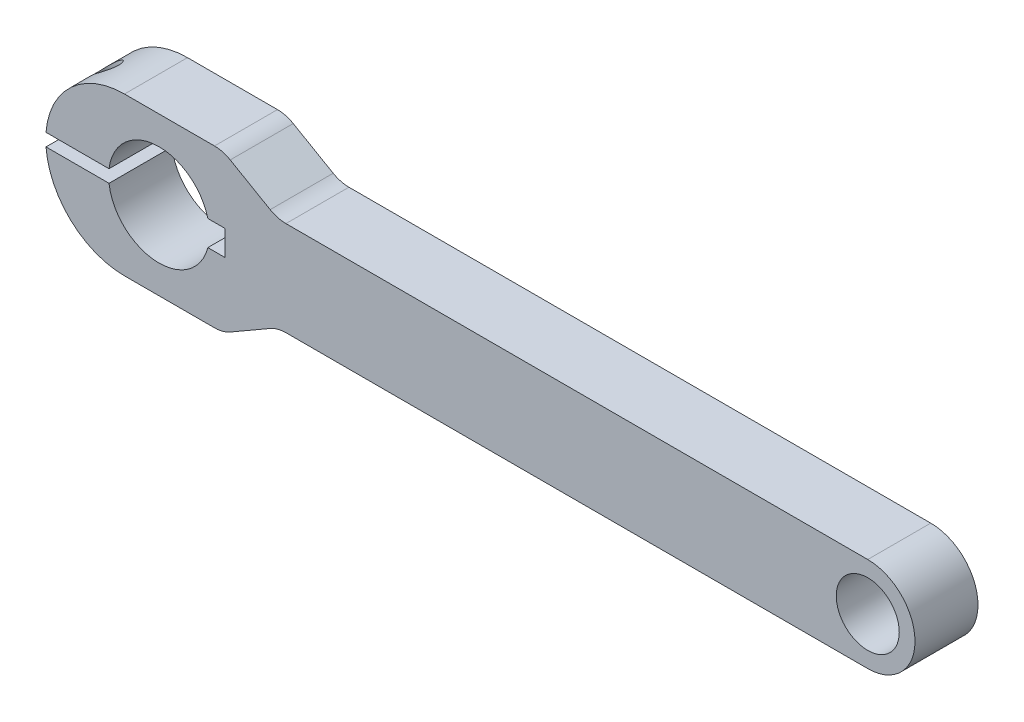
ISO-10303-21;
HEADER;
FILE_DESCRIPTION(('STEP AP214'),'2;1');
FILE_NAME('part.step','',(''),(''),'','','');
FILE_SCHEMA(('AUTOMOTIVE_DESIGN { 1 0 10303 214 1 1 1 1 }'));
ENDSEC;
DATA;
#1=APPLICATION_CONTEXT('core data for automotive mechanical design processes');
#2=APPLICATION_PROTOCOL_DEFINITION('international standard','automotive_design',2000,#1);
#3=PRODUCT_CONTEXT('',#1,'mechanical');
#4=PRODUCT('Part','Part','',(#3));
#5=PRODUCT_RELATED_PRODUCT_CATEGORY('part','',(#4));
#6=PRODUCT_DEFINITION_FORMATION('','',#4);
#7=PRODUCT_DEFINITION_CONTEXT('part definition',#1,'design');
#8=PRODUCT_DEFINITION('design','',#6,#7);
#9=PRODUCT_DEFINITION_SHAPE('','',#8);
#10=(LENGTH_UNIT() NAMED_UNIT(*) SI_UNIT(.MILLI.,.METRE.));
#11=(NAMED_UNIT(*) PLANE_ANGLE_UNIT() SI_UNIT($,.RADIAN.));
#12=(NAMED_UNIT(*) SI_UNIT($,.STERADIAN.) SOLID_ANGLE_UNIT());
#13=UNCERTAINTY_MEASURE_WITH_UNIT(LENGTH_MEASURE(1.E-05),#10,'distance_accuracy_value','');
#14=(GEOMETRIC_REPRESENTATION_CONTEXT(3) GLOBAL_UNCERTAINTY_ASSIGNED_CONTEXT((#13)) GLOBAL_UNIT_ASSIGNED_CONTEXT((#10,
#11,#12)) REPRESENTATION_CONTEXT('',''));
#15=CARTESIAN_POINT('',(0.,0.,0.));
#16=DIRECTION('',(0.,0.,1.));
#17=DIRECTION('',(1.,0.,0.));
#18=AXIS2_PLACEMENT_3D('',#15,#16,#17);
#19=CARTESIAN_POINT('',(-300.,177.493064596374,20.));
#20=DIRECTION('',(0.,0.,-1.));
#21=DIRECTION('',(-1.,0.,0.));
#22=AXIS2_PLACEMENT_3D('',#19,#20,#21);
#23=CYLINDRICAL_SURFACE('',#22,16.);
#24=DIRECTION('',(0.,0.,-1.));
#25=VECTOR('',#24,1.);
#26=CARTESIAN_POINT('',(-315.874507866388,179.493064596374,20.));
#27=LINE('',#26,#25);
#28=CARTESIAN_POINT('',(-315.874507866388,179.493064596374,0.));
#29=VERTEX_POINT('',#28);
#30=CARTESIAN_POINT('',(-315.874507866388,179.493064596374,20.));
#31=VERTEX_POINT('',#30);
#32=EDGE_CURVE('E182',#29,#31,#27,.F.);
#33=ORIENTED_EDGE('',*,*,#32,.F.);
#34=CARTESIAN_POINT('',(-300.,177.493064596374,0.));
#35=DIRECTION('',(0.,0.,1.));
#36=DIRECTION('',(1.,0.,0.));
#37=AXIS2_PLACEMENT_3D('',#34,#35,#36);
#38=CIRCLE('',#37,16.);
#39=CARTESIAN_POINT('',(-284.50806661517,181.493064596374,0.));
#40=VERTEX_POINT('',#39);
#41=EDGE_CURVE('E201',#40,#29,#38,.T.);
#42=ORIENTED_EDGE('',*,*,#41,.F.);
#43=DIRECTION('',(0.,0.,-1.));
#44=VECTOR('',#43,1.);
#45=CARTESIAN_POINT('',(-284.50806661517,181.493064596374,20.));
#46=LINE('',#45,#44);
#47=CARTESIAN_POINT('',(-284.50806661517,181.493064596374,20.));
#48=VERTEX_POINT('',#47);
#49=EDGE_CURVE('E292',#48,#40,#46,.T.);
#50=ORIENTED_EDGE('',*,*,#49,.F.);
#51=CARTESIAN_POINT('',(-300.,177.493064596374,20.));
#52=DIRECTION('',(0.,0.,1.));
#53=DIRECTION('',(1.,0.,0.));
#54=AXIS2_PLACEMENT_3D('',#51,#52,#53);
#55=CIRCLE('',#54,16.);
#56=EDGE_CURVE('E210',#48,#31,#55,.T.);
#57=ORIENTED_EDGE('',*,*,#56,.T.);
#58=EDGE_LOOP('',(#33,#42,#50,#57));
#59=FACE_BOUND('',#58,.T.);
#60=ADVANCED_FACE('F35',(#59),#23,.F.);
#61=CARTESIAN_POINT('',(-310.960972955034,177.493064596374,20.));
#62=DIRECTION('',(0.,0.,-1.));
#63=DIRECTION('',(-1.,0.,0.));
#64=AXIS2_PLACEMENT_3D('',#61,#62,#63);
#65=CYLINDRICAL_SURFACE('',#64,25.);
#66=CARTESIAN_POINT('',(-326.297546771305,197.236152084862,6.49999999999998));
#67=CARTESIAN_POINT('',(-326.531022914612,197.054774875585,6.50000406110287));
#68=CARTESIAN_POINT('',(-326.761650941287,196.868913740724,6.52337521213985));
#69=CARTESIAN_POINT('',(-327.098758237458,196.587401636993,6.59099591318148));
#70=CARTESIAN_POINT('',(-327.209900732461,196.49288990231,6.61906603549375));
#71=CARTESIAN_POINT('',(-327.428680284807,196.303578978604,6.68584927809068));
#72=CARTESIAN_POINT('',(-327.536318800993,196.208779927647,6.72455790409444));
#73=CARTESIAN_POINT('',(-327.757542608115,196.010606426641,6.81658997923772));
#74=CARTESIAN_POINT('',(-327.870729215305,195.907267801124,6.87094855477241));
#75=CARTESIAN_POINT('',(-328.091614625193,195.701959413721,6.99214461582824));
#76=CARTESIAN_POINT('',(-328.199311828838,195.599990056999,7.0589857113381));
#77=CARTESIAN_POINT('',(-328.408193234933,195.398803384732,7.20511385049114));
#78=CARTESIAN_POINT('',(-328.509389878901,195.299581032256,7.28437605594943));
#79=CARTESIAN_POINT('',(-328.70447241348,195.105196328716,7.45568333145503));
#80=CARTESIAN_POINT('',(-328.798362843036,195.010031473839,7.54772036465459));
#81=CARTESIAN_POINT('',(-328.99792728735,194.804710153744,7.76736027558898));
#82=CARTESIAN_POINT('',(-329.101483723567,194.696012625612,7.89830306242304));
#83=CARTESIAN_POINT('',(-329.292521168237,194.492293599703,8.18090270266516));
#84=CARTESIAN_POINT('',(-329.380028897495,194.397249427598,8.33252437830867));
#85=CARTESIAN_POINT('',(-329.517096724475,194.246519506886,8.62018204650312));
#86=CARTESIAN_POINT('',(-329.570766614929,194.186785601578,8.75211465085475));
#87=CARTESIAN_POINT('',(-329.662815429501,194.083601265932,9.02741904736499));
#88=CARTESIAN_POINT('',(-329.701206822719,194.040137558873,9.1707813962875));
#89=CARTESIAN_POINT('',(-329.74528959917,193.99003214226,9.39265005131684));
#90=CARTESIAN_POINT('',(-329.757764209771,193.975809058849,9.46818482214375));
#91=CARTESIAN_POINT('',(-329.777784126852,193.952950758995,9.62072392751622));
#92=CARTESIAN_POINT('',(-329.785332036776,193.944312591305,9.69772746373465));
#93=CARTESIAN_POINT('',(-329.795294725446,193.932905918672,9.85246631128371));
#94=CARTESIAN_POINT('',(-329.797711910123,193.930134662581,9.93020126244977));
#95=CARTESIAN_POINT('',(-329.797363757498,193.930533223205,10.0856179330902));
#96=CARTESIAN_POINT('',(-329.794599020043,193.933702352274,10.1632996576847));
#97=CARTESIAN_POINT('',(-329.780204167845,193.950183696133,10.3719956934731));
#98=CARTESIAN_POINT('',(-329.763724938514,193.969040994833,10.5023001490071));
#99=CARTESIAN_POINT('',(-329.717141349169,194.022049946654,10.7571178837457));
#100=CARTESIAN_POINT('',(-329.687029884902,194.056209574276,10.8816281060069));
#101=CARTESIAN_POINT('',(-329.603119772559,194.150660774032,11.1623663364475));
#102=CARTESIAN_POINT('',(-329.54479020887,194.215849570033,11.3155893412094));
#103=CARTESIAN_POINT('',(-329.411484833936,194.362815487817,11.6059462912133));
#104=CARTESIAN_POINT('',(-329.336474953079,194.44462653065,11.7430464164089));
#105=CARTESIAN_POINT('',(-329.139084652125,194.656538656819,12.0548725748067));
#106=CARTESIAN_POINT('',(-329.010008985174,194.792531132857,12.2213735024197));
#107=CARTESIAN_POINT('',(-328.801655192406,195.006492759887,12.4474417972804));
#108=CARTESIAN_POINT('',(-328.72964405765,195.079576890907,12.5189281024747));
#109=CARTESIAN_POINT('',(-328.581198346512,195.228302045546,12.6542442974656));
#110=CARTESIAN_POINT('',(-328.504764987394,195.303942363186,12.71807627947));
#111=CARTESIAN_POINT('',(-328.325006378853,195.479459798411,12.8558221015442));
#112=CARTESIAN_POINT('',(-328.220356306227,195.579952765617,12.9272210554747));
#113=CARTESIAN_POINT('',(-328.00527817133,195.782775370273,13.057691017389));
#114=CARTESIAN_POINT('',(-327.894848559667,195.885105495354,13.1167586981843));
#115=CARTESIAN_POINT('',(-327.668918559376,196.090587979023,13.2225612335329));
#116=CARTESIAN_POINT('',(-327.553417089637,196.193740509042,13.2692934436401));
#117=CARTESIAN_POINT('',(-327.317981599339,196.400015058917,13.3502560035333));
#118=CARTESIAN_POINT('',(-327.198045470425,196.503137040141,13.3844803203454));
#119=CARTESIAN_POINT('',(-326.953777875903,196.709095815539,13.4402242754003));
#120=CARTESIAN_POINT('',(-326.82942496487,196.811927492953,13.4616691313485));
#121=CARTESIAN_POINT('',(-326.577783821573,197.015908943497,13.491061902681));
#122=CARTESIAN_POINT('',(-326.450495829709,197.117058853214,13.4990109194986));
#123=CARTESIAN_POINT('',(-326.194021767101,197.316802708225,13.5008145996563));
#124=CARTESIAN_POINT('',(-326.064837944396,197.415399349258,13.4946847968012));
#125=CARTESIAN_POINT('',(-325.805617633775,197.609295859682,13.4677070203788));
#126=CARTESIAN_POINT('',(-325.675581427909,197.704596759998,13.4468636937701));
#127=CARTESIAN_POINT('',(-325.347918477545,197.93994329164,13.3747857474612));
#128=CARTESIAN_POINT('',(-325.150488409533,198.07734063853,13.3133605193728));
#129=CARTESIAN_POINT('',(-324.762832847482,198.339247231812,13.1525576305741));
#130=CARTESIAN_POINT('',(-324.572598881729,198.463771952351,13.0532262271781));
#131=CARTESIAN_POINT('',(-324.234373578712,198.679164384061,12.8333035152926));
#132=CARTESIAN_POINT('',(-324.084326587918,198.772278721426,12.7181377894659));
#133=CARTESIAN_POINT('',(-323.871743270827,198.901449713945,12.5248150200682));
#134=CARTESIAN_POINT('',(-323.802933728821,198.942773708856,12.4569080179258));
#135=CARTESIAN_POINT('',(-323.670234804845,199.021664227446,12.3144528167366));
#136=CARTESIAN_POINT('',(-323.606343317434,199.05923236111,12.2399074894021));
#137=CARTESIAN_POINT('',(-323.483855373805,199.13058940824,12.0839950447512));
#138=CARTESIAN_POINT('',(-323.425296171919,199.164352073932,12.0025866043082));
#139=CARTESIAN_POINT('',(-323.314759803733,199.2275533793,11.8338877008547));
#140=CARTESIAN_POINT('',(-323.262779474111,199.256994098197,11.7466000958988));
#141=CARTESIAN_POINT('',(-323.166131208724,199.311341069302,11.5667349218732));
#142=CARTESIAN_POINT('',(-323.1214622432,199.336247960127,11.4741581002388));
#143=CARTESIAN_POINT('',(-323.040120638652,199.381334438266,11.2844539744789));
#144=CARTESIAN_POINT('',(-323.003446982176,199.401514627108,11.18732725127));
#145=CARTESIAN_POINT('',(-322.942294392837,199.435011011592,11.000422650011));
#146=CARTESIAN_POINT('',(-322.916912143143,199.448841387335,10.9110312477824));
#147=CARTESIAN_POINT('',(-322.873251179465,199.472560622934,10.729982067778));
#148=CARTESIAN_POINT('',(-322.854974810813,199.482448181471,10.6383235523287));
#149=CARTESIAN_POINT('',(-322.825801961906,199.498202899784,10.4535663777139));
#150=CARTESIAN_POINT('',(-322.814899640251,199.504073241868,10.3604689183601));
#151=CARTESIAN_POINT('',(-322.800591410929,199.511772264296,10.1735245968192));
#152=CARTESIAN_POINT('',(-322.797188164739,199.513599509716,10.079677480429));
#153=CARTESIAN_POINT('',(-322.798298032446,199.513006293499,9.81073526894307));
#154=CARTESIAN_POINT('',(-322.812203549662,199.505545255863,9.63556978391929));
#155=CARTESIAN_POINT('',(-322.865754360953,199.476628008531,9.29054258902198));
#156=CARTESIAN_POINT('',(-322.905396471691,199.45517352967,9.12068022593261));
#157=CARTESIAN_POINT('',(-323.008404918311,199.398835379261,8.79117814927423));
#158=CARTESIAN_POINT('',(-323.071708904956,199.363986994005,8.63151284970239));
#159=CARTESIAN_POINT('',(-323.21927458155,199.281620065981,8.32575870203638));
#160=CARTESIAN_POINT('',(-323.303539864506,199.234099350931,8.17967218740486));
#161=CARTESIAN_POINT('',(-323.494630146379,199.124526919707,7.89658521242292));
#162=CARTESIAN_POINT('',(-323.602419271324,199.061834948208,7.76048602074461));
#163=CARTESIAN_POINT('',(-323.833276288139,198.924859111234,7.50869877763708));
#164=CARTESIAN_POINT('',(-323.956348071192,198.850572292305,7.39301594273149));
#165=CARTESIAN_POINT('',(-324.227276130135,198.683465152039,7.1719821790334));
#166=CARTESIAN_POINT('',(-324.376377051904,198.589515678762,7.06901739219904));
#167=CARTESIAN_POINT('',(-324.683286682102,198.391187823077,6.88939869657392));
#168=CARTESIAN_POINT('',(-324.84110317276,198.286800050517,6.8127687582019));
#169=CARTESIAN_POINT('',(-325.185730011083,198.052880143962,6.6753389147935));
#170=CARTESIAN_POINT('',(-325.373270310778,197.921948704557,6.61877872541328));
#171=CARTESIAN_POINT('',(-325.748873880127,197.651720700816,6.5379457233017));
#172=CARTESIAN_POINT('',(-325.936936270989,197.512434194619,6.5136348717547));
#173=CARTESIAN_POINT('',(-326.181523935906,197.325872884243,6.5014362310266));
#174=CARTESIAN_POINT('',(-326.239623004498,197.281150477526,6.4999989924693));
#175=CARTESIAN_POINT('',(-326.297546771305,197.236152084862,6.49999999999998));
#176=B_SPLINE_CURVE_WITH_KNOTS('',3,(#66,#67,#68,#69,#70,#71,#72,#73,#74,#75,#76,#77,#78,#79,
#80,#81,#82,#83,#84,#85,#86,#87,#88,#89,#90,#91,#92,#93,#94,#95,#96,#97,#98,#99,#100,#101,#102,
#103,#104,#105,#106,#107,#108,#109,#110,#111,#112,#113,#114,#115,#116,#117,#118,#119,#120,#121,
#122,#123,#124,#125,#126,#127,#128,#129,#130,#131,#132,#133,#134,#135,#136,#137,#138,#139,#140,
#141,#142,#143,#144,#145,#146,#147,#148,#149,#150,#151,#152,#153,#154,#155,#156,#157,#158,#159,
#160,#161,#162,#163,#164,#165,#166,#167,#168,#169,#170,#171,#172,#173,#174,#175),.UNSPECIFIED.,
.T.,.F.,(4,2,2,2,2,2,2,2,2,2,2,2,2,2,2,2,2,2,2,2,2,2,2,2,2,2,2,2,2,2,2,2,2,2,2,2,2,2,2,2,2,2,2,
2,2,2,2,2,2,2,2,2,2,2,4),(0.,0.886740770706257,1.33216892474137,1.77740919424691,
2.26470657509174,2.75214510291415,3.23862106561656,3.72479235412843,4.32060203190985,
4.91541050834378,5.37713186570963,5.83847562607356,6.07176637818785,6.3049337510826,
6.53799176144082,6.77102279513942,7.16708561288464,7.56335507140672,8.08970498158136,
8.61714000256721,9.36502952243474,9.73994949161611,10.1147667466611,10.5992538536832,
11.0838715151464,11.5685929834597,12.0535479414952,12.5413135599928,13.0290393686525,
13.5162273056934,14.0032614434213,14.744856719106,15.4855498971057,16.1151153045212,
16.4301966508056,16.7451423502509,17.0621422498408,17.3789891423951,17.6957913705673,
18.0125532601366,18.2940323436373,18.5756042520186,18.8569528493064,19.138401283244,
19.663269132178,20.1880720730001,20.7115017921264,21.2350212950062,21.7864861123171,
22.3380916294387,22.9480271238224,23.5585163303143,24.2627812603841,24.9662147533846,
25.1862088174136),.UNSPECIFIED.);
#177=CARTESIAN_POINT('',(-326.297546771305,197.236152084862,6.49999999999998));
#178=VERTEX_POINT('',#177);
#179=EDGE_CURVE('E195',#178,#178,#176,.T.);
#180=ORIENTED_EDGE('',*,*,#179,.F.);
#181=EDGE_LOOP('',(#180));
#182=FACE_BOUND('',#181,.T.);
#183=DIRECTION('',(0.,0.,-1.));
#184=VECTOR('',#183,1.);
#185=CARTESIAN_POINT('',(-335.880844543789,179.493064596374,20.));
#186=LINE('',#185,#184);
#187=CARTESIAN_POINT('',(-335.880844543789,179.493064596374,20.));
#188=VERTEX_POINT('',#187);
#189=CARTESIAN_POINT('',(-335.880844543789,179.493064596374,0.));
#190=VERTEX_POINT('',#189);
#191=EDGE_CURVE('E11',#188,#190,#186,.T.);
#192=ORIENTED_EDGE('',*,*,#191,.F.);
#193=CARTESIAN_POINT('',(-310.960972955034,177.493064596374,20.));
#194=DIRECTION('',(0.,0.,-1.));
#195=DIRECTION('',(-1.,0.,0.));
#196=AXIS2_PLACEMENT_3D('',#193,#194,#195);
#197=CIRCLE('',#196,25.);
#198=CARTESIAN_POINT('',(-310.960972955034,202.493064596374,20.));
#199=VERTEX_POINT('',#198);
#200=EDGE_CURVE('E426',#188,#199,#197,.T.);
#201=ORIENTED_EDGE('',*,*,#200,.T.);
#202=DIRECTION('',(0.,0.,-1.));
#203=VECTOR('',#202,1.);
#204=CARTESIAN_POINT('',(-310.960972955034,202.493064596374,20.));
#205=LINE('',#204,#203);
#206=CARTESIAN_POINT('',(-310.960972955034,202.493064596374,0.));
#207=VERTEX_POINT('',#206);
#208=EDGE_CURVE('E416',#199,#207,#205,.T.);
#209=ORIENTED_EDGE('',*,*,#208,.T.);
#210=CARTESIAN_POINT('',(-310.960972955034,177.493064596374,0.));
#211=DIRECTION('',(0.,0.,-1.));
#212=DIRECTION('',(-1.,0.,0.));
#213=AXIS2_PLACEMENT_3D('',#210,#211,#212);
#214=CIRCLE('',#213,25.);
#215=EDGE_CURVE('E528',#190,#207,#214,.T.);
#216=ORIENTED_EDGE('',*,*,#215,.F.);
#217=EDGE_LOOP('',(#192,#201,#209,#216));
#218=FACE_BOUND('',#217,.T.);
#219=ADVANCED_FACE('F339',(#182,#218),#65,.T.);
#220=CARTESIAN_POINT('',(-300.,177.493064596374,20.));
#221=DIRECTION('',(0.,0.,1.));
#222=DIRECTION('',(1.,0.,0.));
#223=AXIS2_PLACEMENT_3D('',#220,#221,#222);
#224=PLANE('',#223);
#225=DIRECTION('',(1.,0.,0.));
#226=VECTOR('',#225,1.);
#227=CARTESIAN_POINT('',(-314.095191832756,179.493064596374,20.));
#228=LINE('',#227,#226);
#229=EDGE_CURVE('E55',#188,#31,#228,.T.);
#230=ORIENTED_EDGE('',*,*,#229,.T.);
#231=ORIENTED_EDGE('',*,*,#56,.F.);
#232=DIRECTION('',(-1.,0.,0.));
#233=VECTOR('',#232,1.);
#234=CARTESIAN_POINT('',(-279.,181.493064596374,20.));
#235=LINE('',#234,#233);
#236=CARTESIAN_POINT('',(-279.,181.493064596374,20.));
#237=VERTEX_POINT('',#236);
#238=EDGE_CURVE('E442',#237,#48,#235,.T.);
#239=ORIENTED_EDGE('',*,*,#238,.F.);
#240=DIRECTION('',(0.,1.,0.));
#241=VECTOR('',#240,1.);
#242=CARTESIAN_POINT('',(-279.,181.493064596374,20.));
#243=LINE('',#242,#241);
#244=CARTESIAN_POINT('',(-279.,173.493064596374,20.));
#245=VERTEX_POINT('',#244);
#246=EDGE_CURVE('E423',#245,#237,#243,.T.);
#247=ORIENTED_EDGE('',*,*,#246,.F.);
#248=DIRECTION('',(1.,0.,0.));
#249=VECTOR('',#248,1.);
#250=CARTESIAN_POINT('',(-279.,173.493064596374,20.));
#251=LINE('',#250,#249);
#252=CARTESIAN_POINT('',(-284.50806661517,173.493064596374,20.));
#253=VERTEX_POINT('',#252);
#254=EDGE_CURVE('E434',#253,#245,#251,.T.);
#255=ORIENTED_EDGE('',*,*,#254,.F.);
#256=CARTESIAN_POINT('',(-315.874507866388,175.493064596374,20.));
#257=VERTEX_POINT('',#256);
#258=EDGE_CURVE('E204',#257,#253,#55,.T.);
#259=ORIENTED_EDGE('',*,*,#258,.F.);
#260=DIRECTION('',(-1.,0.,0.));
#261=VECTOR('',#260,1.);
#262=CARTESIAN_POINT('',(-314.095191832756,175.493064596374,20.));
#263=LINE('',#262,#261);
#264=CARTESIAN_POINT('',(-335.880844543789,175.493064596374,20.));
#265=VERTEX_POINT('',#264);
#266=EDGE_CURVE('E178',#257,#265,#263,.T.);
#267=ORIENTED_EDGE('',*,*,#266,.T.);
#268=CARTESIAN_POINT('',(-310.960972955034,152.493064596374,20.));
#269=VERTEX_POINT('',#268);
#270=EDGE_CURVE('E420',#269,#265,#197,.T.);
#271=ORIENTED_EDGE('',*,*,#270,.F.);
#272=DIRECTION('',(1.,0.,0.));
#273=VECTOR('',#272,1.);
#274=CARTESIAN_POINT('',(-300.,152.493064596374,20.));
#275=LINE('',#274,#273);
#276=CARTESIAN_POINT('',(-282.391265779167,152.493064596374,20.));
#277=VERTEX_POINT('',#276);
#278=EDGE_CURVE('E212',#269,#277,#275,.T.);
#279=ORIENTED_EDGE('',*,*,#278,.T.);
#280=CARTESIAN_POINT('',(-282.391265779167,162.493064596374,20.));
#281=DIRECTION('',(0.,0.,1.));
#282=DIRECTION('',(1.,0.,0.));
#283=AXIS2_PLACEMENT_3D('',#280,#281,#282);
#284=CIRCLE('',#283,10.);
#285=CARTESIAN_POINT('',(-277.391265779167,153.83281055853,20.));
#286=VERTEX_POINT('',#285);
#287=EDGE_CURVE('E272',#277,#286,#284,.T.);
#288=ORIENTED_EDGE('',*,*,#287,.T.);
#289=DIRECTION('',(0.866025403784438,0.500000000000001,0.));
#290=VECTOR('',#289,1.);
#291=CARTESIAN_POINT('',(-279.711773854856,152.493064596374,20.));
#292=LINE('',#291,#290);
#293=CARTESIAN_POINT('',(-264.711773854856,161.153318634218,20.));
#294=VERTEX_POINT('',#293);
#295=EDGE_CURVE('E214',#286,#294,#292,.T.);
#296=ORIENTED_EDGE('',*,*,#295,.T.);
#297=CARTESIAN_POINT('',(-259.711773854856,152.493064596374,20.));
#298=DIRECTION('',(0.,0.,1.));
#299=DIRECTION('',(1.,0.,0.));
#300=AXIS2_PLACEMENT_3D('',#297,#298,#299);
#301=CIRCLE('',#300,10.);
#302=CARTESIAN_POINT('',(-259.711773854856,162.493064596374,20.));
#303=VERTEX_POINT('',#302);
#304=EDGE_CURVE('E286',#294,#303,#301,.F.);
#305=ORIENTED_EDGE('',*,*,#304,.T.);
#306=DIRECTION('',(1.,0.,0.));
#307=VECTOR('',#306,1.);
#308=CARTESIAN_POINT('',(-262.391265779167,162.493064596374,20.));
#309=LINE('',#308,#307);
#310=CARTESIAN_POINT('',(-75.,162.493064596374,20.));
#311=VERTEX_POINT('',#310);
#312=EDGE_CURVE('E218',#303,#311,#309,.T.);
#313=ORIENTED_EDGE('',*,*,#312,.T.);
#314=CARTESIAN_POINT('',(-75.,177.493064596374,20.));
#315=DIRECTION('',(0.,0.,1.));
#316=DIRECTION('',(1.,0.,0.));
#317=AXIS2_PLACEMENT_3D('',#314,#315,#316);
#318=CIRCLE('',#317,15.);
#319=CARTESIAN_POINT('',(-75.,192.493064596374,20.));
#320=VERTEX_POINT('',#319);
#321=EDGE_CURVE('E220',#311,#320,#318,.T.);
#322=ORIENTED_EDGE('',*,*,#321,.T.);
#323=DIRECTION('',(-1.,0.,0.));
#324=VECTOR('',#323,1.);
#325=CARTESIAN_POINT('',(-262.391265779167,192.493064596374,20.));
#326=LINE('',#325,#324);
#327=CARTESIAN_POINT('',(-259.711773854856,192.493064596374,20.));
#328=VERTEX_POINT('',#327);
#329=EDGE_CURVE('E222',#320,#328,#326,.T.);
#330=ORIENTED_EDGE('',*,*,#329,.T.);
#331=CARTESIAN_POINT('',(-259.711773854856,202.493064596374,20.));
#332=DIRECTION('',(0.,0.,1.));
#333=DIRECTION('',(1.,0.,0.));
#334=AXIS2_PLACEMENT_3D('',#331,#332,#333);
#335=CIRCLE('',#334,10.);
#336=CARTESIAN_POINT('',(-264.711773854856,193.83281055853,20.));
#337=VERTEX_POINT('',#336);
#338=EDGE_CURVE('E290',#328,#337,#335,.F.);
#339=ORIENTED_EDGE('',*,*,#338,.T.);
#340=DIRECTION('',(-0.866025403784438,0.500000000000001,0.));
#341=VECTOR('',#340,1.);
#342=CARTESIAN_POINT('',(-279.711773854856,202.493064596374,20.));
#343=LINE('',#342,#341);
#344=CARTESIAN_POINT('',(-277.391265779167,201.153318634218,20.));
#345=VERTEX_POINT('',#344);
#346=EDGE_CURVE('E225',#337,#345,#343,.T.);
#347=ORIENTED_EDGE('',*,*,#346,.T.);
#348=CARTESIAN_POINT('',(-282.391265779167,192.493064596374,20.));
#349=DIRECTION('',(0.,0.,1.));
#350=DIRECTION('',(1.,0.,0.));
#351=AXIS2_PLACEMENT_3D('',#348,#349,#350);
#352=CIRCLE('',#351,10.);
#353=CARTESIAN_POINT('',(-282.391265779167,202.493064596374,20.));
#354=VERTEX_POINT('',#353);
#355=EDGE_CURVE('E270',#345,#354,#352,.T.);
#356=ORIENTED_EDGE('',*,*,#355,.T.);
#357=DIRECTION('',(-1.,0.,0.));
#358=VECTOR('',#357,1.);
#359=CARTESIAN_POINT('',(-300.,202.493064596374,20.));
#360=LINE('',#359,#358);
#361=EDGE_CURVE('E228',#354,#199,#360,.T.);
#362=ORIENTED_EDGE('',*,*,#361,.T.);
#363=ORIENTED_EDGE('',*,*,#200,.F.);
#364=EDGE_LOOP('',(#230,#231,#239,#247,#255,#259,#267,#271,#279,#288,#296,#305,#313,#322,#330,
#339,#347,#356,#362,#363));
#365=FACE_BOUND('',#364,.T.);
#366=CARTESIAN_POINT('',(-75.,177.493064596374,20.));
#367=DIRECTION('',(0.,0.,1.));
#368=DIRECTION('',(1.,0.,0.));
#369=AXIS2_PLACEMENT_3D('',#366,#367,#368);
#370=CIRCLE('',#369,10.);
#371=CARTESIAN_POINT('',(-65.,177.493064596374,20.));
#372=VERTEX_POINT('',#371);
#373=EDGE_CURVE('E202',#372,#372,#370,.T.);
#374=ORIENTED_EDGE('',*,*,#373,.F.);
#375=EDGE_LOOP('',(#374));
#376=FACE_BOUND('',#375,.T.);
#377=ADVANCED_FACE('F347',(#365,#376),#224,.T.);
#378=CARTESIAN_POINT('',(-300.,177.493064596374,0.));
#379=DIRECTION('',(0.,0.,1.));
#380=DIRECTION('',(1.,0.,0.));
#381=AXIS2_PLACEMENT_3D('',#378,#379,#380);
#382=PLANE('',#381);
#383=ORIENTED_EDGE('',*,*,#41,.T.);
#384=DIRECTION('',(1.,0.,0.));
#385=VECTOR('',#384,1.);
#386=CARTESIAN_POINT('',(-314.095191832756,179.493064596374,0.));
#387=LINE('',#386,#385);
#388=EDGE_CURVE('E194',#190,#29,#387,.T.);
#389=ORIENTED_EDGE('',*,*,#388,.F.);
#390=ORIENTED_EDGE('',*,*,#215,.T.);
#391=DIRECTION('',(-1.,0.,0.));
#392=VECTOR('',#391,1.);
#393=CARTESIAN_POINT('',(-300.,202.493064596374,0.));
#394=LINE('',#393,#392);
#395=CARTESIAN_POINT('',(-282.391265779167,202.493064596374,0.));
#396=VERTEX_POINT('',#395);
#397=EDGE_CURVE('E215',#396,#207,#394,.T.);
#398=ORIENTED_EDGE('',*,*,#397,.F.);
#399=CARTESIAN_POINT('',(-282.391265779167,192.493064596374,0.));
#400=DIRECTION('',(0.,0.,1.));
#401=DIRECTION('',(1.,0.,0.));
#402=AXIS2_PLACEMENT_3D('',#399,#400,#401);
#403=CIRCLE('',#402,10.);
#404=CARTESIAN_POINT('',(-277.391265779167,201.153318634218,0.));
#405=VERTEX_POINT('',#404);
#406=EDGE_CURVE('E262',#396,#405,#403,.F.);
#407=ORIENTED_EDGE('',*,*,#406,.T.);
#408=DIRECTION('',(-0.866025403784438,0.500000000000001,0.));
#409=VECTOR('',#408,1.);
#410=CARTESIAN_POINT('',(-279.711773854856,202.493064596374,0.));
#411=LINE('',#410,#409);
#412=CARTESIAN_POINT('',(-264.711773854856,193.83281055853,0.));
#413=VERTEX_POINT('',#412);
#414=EDGE_CURVE('E244',#413,#405,#411,.T.);
#415=ORIENTED_EDGE('',*,*,#414,.F.);
#416=CARTESIAN_POINT('',(-259.711773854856,202.493064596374,0.));
#417=DIRECTION('',(0.,0.,1.));
#418=DIRECTION('',(1.,0.,0.));
#419=AXIS2_PLACEMENT_3D('',#416,#417,#418);
#420=CIRCLE('',#419,10.);
#421=CARTESIAN_POINT('',(-259.711773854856,192.493064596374,0.));
#422=VERTEX_POINT('',#421);
#423=EDGE_CURVE('E288',#413,#422,#420,.T.);
#424=ORIENTED_EDGE('',*,*,#423,.T.);
#425=DIRECTION('',(-1.,0.,0.));
#426=VECTOR('',#425,1.);
#427=CARTESIAN_POINT('',(-262.391265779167,192.493064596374,0.));
#428=LINE('',#427,#426);
#429=CARTESIAN_POINT('',(-75.,192.493064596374,0.));
#430=VERTEX_POINT('',#429);
#431=EDGE_CURVE('E241',#430,#422,#428,.T.);
#432=ORIENTED_EDGE('',*,*,#431,.F.);
#433=CARTESIAN_POINT('',(-75.,177.493064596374,0.));
#434=DIRECTION('',(0.,0.,1.));
#435=DIRECTION('',(1.,0.,0.));
#436=AXIS2_PLACEMENT_3D('',#433,#434,#435);
#437=CIRCLE('',#436,15.);
#438=CARTESIAN_POINT('',(-75.,162.493064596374,0.));
#439=VERTEX_POINT('',#438);
#440=EDGE_CURVE('E239',#439,#430,#437,.T.);
#441=ORIENTED_EDGE('',*,*,#440,.F.);
#442=DIRECTION('',(1.,0.,0.));
#443=VECTOR('',#442,1.);
#444=CARTESIAN_POINT('',(-262.391265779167,162.493064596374,0.));
#445=LINE('',#444,#443);
#446=CARTESIAN_POINT('',(-259.711773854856,162.493064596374,0.));
#447=VERTEX_POINT('',#446);
#448=EDGE_CURVE('E237',#447,#439,#445,.T.);
#449=ORIENTED_EDGE('',*,*,#448,.F.);
#450=CARTESIAN_POINT('',(-259.711773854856,152.493064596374,0.));
#451=DIRECTION('',(0.,0.,1.));
#452=DIRECTION('',(1.,0.,0.));
#453=AXIS2_PLACEMENT_3D('',#450,#451,#452);
#454=CIRCLE('',#453,10.);
#455=CARTESIAN_POINT('',(-264.711773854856,161.153318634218,0.));
#456=VERTEX_POINT('',#455);
#457=EDGE_CURVE('E284',#447,#456,#454,.T.);
#458=ORIENTED_EDGE('',*,*,#457,.T.);
#459=DIRECTION('',(0.866025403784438,0.500000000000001,0.));
#460=VECTOR('',#459,1.);
#461=CARTESIAN_POINT('',(-279.711773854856,152.493064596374,0.));
#462=LINE('',#461,#460);
#463=CARTESIAN_POINT('',(-277.391265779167,153.83281055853,0.));
#464=VERTEX_POINT('',#463);
#465=EDGE_CURVE('E234',#464,#456,#462,.T.);
#466=ORIENTED_EDGE('',*,*,#465,.F.);
#467=CARTESIAN_POINT('',(-282.391265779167,162.493064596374,0.));
#468=DIRECTION('',(0.,0.,1.));
#469=DIRECTION('',(1.,0.,0.));
#470=AXIS2_PLACEMENT_3D('',#467,#468,#469);
#471=CIRCLE('',#470,10.);
#472=CARTESIAN_POINT('',(-282.391265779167,152.493064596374,0.));
#473=VERTEX_POINT('',#472);
#474=EDGE_CURVE('E264',#464,#473,#471,.F.);
#475=ORIENTED_EDGE('',*,*,#474,.T.);
#476=DIRECTION('',(1.,0.,0.));
#477=VECTOR('',#476,1.);
#478=CARTESIAN_POINT('',(-300.,152.493064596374,0.));
#479=LINE('',#478,#477);
#480=CARTESIAN_POINT('',(-310.960972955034,152.493064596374,0.));
#481=VERTEX_POINT('',#480);
#482=EDGE_CURVE('E232',#481,#473,#479,.T.);
#483=ORIENTED_EDGE('',*,*,#482,.F.);
#484=CARTESIAN_POINT('',(-335.880844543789,175.493064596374,0.));
#485=VERTEX_POINT('',#484);
#486=EDGE_CURVE('E193',#481,#485,#214,.T.);
#487=ORIENTED_EDGE('',*,*,#486,.T.);
#488=DIRECTION('',(-1.,0.,0.));
#489=VECTOR('',#488,1.);
#490=CARTESIAN_POINT('',(-314.095191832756,175.493064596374,0.));
#491=LINE('',#490,#489);
#492=CARTESIAN_POINT('',(-315.874507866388,175.493064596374,0.));
#493=VERTEX_POINT('',#492);
#494=EDGE_CURVE('E63',#493,#485,#491,.T.);
#495=ORIENTED_EDGE('',*,*,#494,.F.);
#496=CARTESIAN_POINT('',(-284.50806661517,173.493064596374,0.));
#497=VERTEX_POINT('',#496);
#498=EDGE_CURVE('E190',#493,#497,#38,.T.);
#499=ORIENTED_EDGE('',*,*,#498,.T.);
#500=DIRECTION('',(1.,0.,0.));
#501=VECTOR('',#500,1.);
#502=CARTESIAN_POINT('',(-279.,173.493064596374,0.));
#503=LINE('',#502,#501);
#504=CARTESIAN_POINT('',(-279.,173.493064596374,0.));
#505=VERTEX_POINT('',#504);
#506=EDGE_CURVE('E437',#497,#505,#503,.T.);
#507=ORIENTED_EDGE('',*,*,#506,.T.);
#508=DIRECTION('',(0.,1.,0.));
#509=VECTOR('',#508,1.);
#510=CARTESIAN_POINT('',(-279.,181.493064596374,0.));
#511=LINE('',#510,#509);
#512=CARTESIAN_POINT('',(-279.,181.493064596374,0.));
#513=VERTEX_POINT('',#512);
#514=EDGE_CURVE('E430',#505,#513,#511,.T.);
#515=ORIENTED_EDGE('',*,*,#514,.T.);
#516=DIRECTION('',(-1.,0.,0.));
#517=VECTOR('',#516,1.);
#518=CARTESIAN_POINT('',(-279.,181.493064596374,0.));
#519=LINE('',#518,#517);
#520=EDGE_CURVE('E433',#513,#40,#519,.T.);
#521=ORIENTED_EDGE('',*,*,#520,.T.);
#522=EDGE_LOOP('',(#383,#389,#390,#398,#407,#415,#424,#432,#441,#449,#458,#466,#475,#483,#487,
#495,#499,#507,#515,#521));
#523=FACE_BOUND('',#522,.T.);
#524=CARTESIAN_POINT('',(-75.,177.493064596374,0.));
#525=DIRECTION('',(0.,0.,1.));
#526=DIRECTION('',(1.,0.,0.));
#527=AXIS2_PLACEMENT_3D('',#524,#525,#526);
#528=CIRCLE('',#527,10.);
#529=CARTESIAN_POINT('',(-65.,177.493064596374,0.));
#530=VERTEX_POINT('',#529);
#531=EDGE_CURVE('E206',#530,#530,#528,.T.);
#532=ORIENTED_EDGE('',*,*,#531,.T.);
#533=EDGE_LOOP('',(#532));
#534=FACE_BOUND('',#533,.T.);
#535=ADVANCED_FACE('F187',(#523,#534),#382,.F.);
#536=CARTESIAN_POINT('',(-300.,152.493064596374,20.));
#537=DIRECTION('',(0.,1.,0.));
#538=DIRECTION('',(-1.,0.,0.));
#539=AXIS2_PLACEMENT_3D('',#536,#537,#538);
#540=PLANE('',#539);
#541=DIRECTION('',(0.,0.,-1.));
#542=VECTOR('',#541,1.);
#543=CARTESIAN_POINT('',(-282.391265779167,152.493064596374,20.));
#544=LINE('',#543,#542);
#545=EDGE_CURVE('E267',#473,#277,#544,.F.);
#546=ORIENTED_EDGE('',*,*,#545,.T.);
#547=ORIENTED_EDGE('',*,*,#278,.F.);
#548=DIRECTION('',(0.,0.,-1.));
#549=VECTOR('',#548,1.);
#550=CARTESIAN_POINT('',(-310.960972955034,152.493064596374,20.));
#551=LINE('',#550,#549);
#552=EDGE_CURVE('E419',#269,#481,#551,.T.);
#553=ORIENTED_EDGE('',*,*,#552,.T.);
#554=ORIENTED_EDGE('',*,*,#482,.T.);
#555=EDGE_LOOP('',(#546,#547,#553,#554));
#556=FACE_BOUND('',#555,.T.);
#557=ADVANCED_FACE('F386',(#556),#540,.F.);
#558=CARTESIAN_POINT('',(-279.711773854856,152.493064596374,20.));
#559=DIRECTION('',(-0.500000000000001,0.866025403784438,0.));
#560=DIRECTION('',(-0.866025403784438,-0.500000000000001,0.));
#561=AXIS2_PLACEMENT_3D('',#558,#559,#560);
#562=PLANE('',#561);
#563=ORIENTED_EDGE('',*,*,#465,.T.);
#564=DIRECTION('',(0.,0.,-1.));
#565=VECTOR('',#564,1.);
#566=CARTESIAN_POINT('',(-264.711773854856,161.153318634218,20.));
#567=LINE('',#566,#565);
#568=EDGE_CURVE('E260',#456,#294,#567,.F.);
#569=ORIENTED_EDGE('',*,*,#568,.T.);
#570=ORIENTED_EDGE('',*,*,#295,.F.);
#571=DIRECTION('',(0.,0.,-1.));
#572=VECTOR('',#571,1.);
#573=CARTESIAN_POINT('',(-277.391265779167,153.83281055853,20.));
#574=LINE('',#573,#572);
#575=EDGE_CURVE('E257',#286,#464,#574,.T.);
#576=ORIENTED_EDGE('',*,*,#575,.T.);
#577=EDGE_LOOP('',(#563,#569,#570,#576));
#578=FACE_BOUND('',#577,.T.);
#579=ADVANCED_FACE('F382',(#578),#562,.F.);
#580=CARTESIAN_POINT('',(-262.391265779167,162.493064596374,20.));
#581=DIRECTION('',(0.,1.,0.));
#582=DIRECTION('',(0.,0.,1.));
#583=AXIS2_PLACEMENT_3D('',#580,#581,#582);
#584=PLANE('',#583);
#585=ORIENTED_EDGE('',*,*,#312,.F.);
#586=DIRECTION('',(0.,0.,-1.));
#587=VECTOR('',#586,1.);
#588=CARTESIAN_POINT('',(-259.711773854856,162.493064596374,0.));
#589=LINE('',#588,#587);
#590=EDGE_CURVE('E254',#303,#447,#589,.T.);
#591=ORIENTED_EDGE('',*,*,#590,.T.);
#592=ORIENTED_EDGE('',*,*,#448,.T.);
#593=DIRECTION('',(0.,0.,-1.));
#594=VECTOR('',#593,1.);
#595=CARTESIAN_POINT('',(-75.,162.493064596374,20.));
#596=LINE('',#595,#594);
#597=EDGE_CURVE('E251',#311,#439,#596,.T.);
#598=ORIENTED_EDGE('',*,*,#597,.F.);
#599=EDGE_LOOP('',(#585,#591,#592,#598));
#600=FACE_BOUND('',#599,.T.);
#601=ADVANCED_FACE('F378',(#600),#584,.F.);
#602=CARTESIAN_POINT('',(-75.,177.493064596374,20.));
#603=DIRECTION('',(0.,0.,-1.));
#604=DIRECTION('',(-1.,0.,0.));
#605=AXIS2_PLACEMENT_3D('',#602,#603,#604);
#606=CYLINDRICAL_SURFACE('',#605,15.);
#607=ORIENTED_EDGE('',*,*,#440,.T.);
#608=DIRECTION('',(0.,0.,-1.));
#609=VECTOR('',#608,1.);
#610=CARTESIAN_POINT('',(-75.,192.493064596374,20.));
#611=LINE('',#610,#609);
#612=EDGE_CURVE('E231',#320,#430,#611,.T.);
#613=ORIENTED_EDGE('',*,*,#612,.F.);
#614=ORIENTED_EDGE('',*,*,#321,.F.);
#615=ORIENTED_EDGE('',*,*,#597,.T.);
#616=EDGE_LOOP('',(#607,#613,#614,#615));
#617=FACE_BOUND('',#616,.T.);
#618=ADVANCED_FACE('F374',(#617),#606,.T.);
#619=CARTESIAN_POINT('',(-262.391265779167,192.493064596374,20.));
#620=DIRECTION('',(0.,-1.,0.));
#621=DIRECTION('',(0.,0.,-1.));
#622=AXIS2_PLACEMENT_3D('',#619,#620,#621);
#623=PLANE('',#622);
#624=ORIENTED_EDGE('',*,*,#431,.T.);
#625=DIRECTION('',(0.,0.,-1.));
#626=VECTOR('',#625,1.);
#627=CARTESIAN_POINT('',(-259.711773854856,192.493064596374,20.));
#628=LINE('',#627,#626);
#629=EDGE_CURVE('E282',#422,#328,#628,.F.);
#630=ORIENTED_EDGE('',*,*,#629,.T.);
#631=ORIENTED_EDGE('',*,*,#329,.F.);
#632=ORIENTED_EDGE('',*,*,#612,.T.);
#633=EDGE_LOOP('',(#624,#630,#631,#632));
#634=FACE_BOUND('',#633,.T.);
#635=ADVANCED_FACE('F367',(#634),#623,.F.);
#636=CARTESIAN_POINT('',(-279.711773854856,202.493064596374,20.));
#637=DIRECTION('',(-0.500000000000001,-0.866025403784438,0.));
#638=DIRECTION('',(0.866025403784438,-0.500000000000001,0.));
#639=AXIS2_PLACEMENT_3D('',#636,#637,#638);
#640=PLANE('',#639);
#641=ORIENTED_EDGE('',*,*,#414,.T.);
#642=DIRECTION('',(0.,0.,-1.));
#643=VECTOR('',#642,1.);
#644=CARTESIAN_POINT('',(-277.391265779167,201.153318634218,20.));
#645=LINE('',#644,#643);
#646=EDGE_CURVE('E280',#405,#345,#645,.F.);
#647=ORIENTED_EDGE('',*,*,#646,.T.);
#648=ORIENTED_EDGE('',*,*,#346,.F.);
#649=DIRECTION('',(0.,0.,-1.));
#650=VECTOR('',#649,1.);
#651=CARTESIAN_POINT('',(-264.711773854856,193.83281055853,0.));
#652=LINE('',#651,#650);
#653=EDGE_CURVE('E277',#337,#413,#652,.T.);
#654=ORIENTED_EDGE('',*,*,#653,.T.);
#655=EDGE_LOOP('',(#641,#647,#648,#654));
#656=FACE_BOUND('',#655,.T.);
#657=ADVANCED_FACE('F361',(#656),#640,.F.);
#658=CARTESIAN_POINT('',(-300.,202.493064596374,20.));
#659=DIRECTION('',(0.,-1.,0.));
#660=DIRECTION('',(0.,0.,-1.));
#661=AXIS2_PLACEMENT_3D('',#658,#659,#660);
#662=PLANE('',#661);
#663=ORIENTED_EDGE('',*,*,#397,.T.);
#664=ORIENTED_EDGE('',*,*,#208,.F.);
#665=ORIENTED_EDGE('',*,*,#361,.F.);
#666=DIRECTION('',(0.,0.,-1.));
#667=VECTOR('',#666,1.);
#668=CARTESIAN_POINT('',(-282.391265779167,202.493064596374,20.));
#669=LINE('',#668,#667);
#670=EDGE_CURVE('E274',#354,#396,#669,.T.);
#671=ORIENTED_EDGE('',*,*,#670,.T.);
#672=EDGE_LOOP('',(#663,#664,#665,#671));
#673=FACE_BOUND('',#672,.T.);
#674=ADVANCED_FACE('F354',(#673),#662,.F.);
#675=DIRECTION('',(0.,0.,-1.));
#676=VECTOR('',#675,1.);
#677=CARTESIAN_POINT('',(-315.874507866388,175.493064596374,20.));
#678=LINE('',#677,#676);
#679=EDGE_CURVE('E175',#257,#493,#678,.T.);
#680=ORIENTED_EDGE('',*,*,#679,.F.);
#681=ORIENTED_EDGE('',*,*,#258,.T.);
#682=DIRECTION('',(0.,0.,-1.));
#683=VECTOR('',#682,1.);
#684=CARTESIAN_POINT('',(-284.50806661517,173.493064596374,20.));
#685=LINE('',#684,#683);
#686=EDGE_CURVE('E200',#497,#253,#685,.F.);
#687=ORIENTED_EDGE('',*,*,#686,.F.);
#688=ORIENTED_EDGE('',*,*,#498,.F.);
#689=EDGE_LOOP('',(#680,#681,#687,#688));
#690=FACE_BOUND('',#689,.T.);
#691=ADVANCED_FACE('F198',(#690),#23,.F.);
#692=CARTESIAN_POINT('',(-75.,177.493064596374,20.));
#693=DIRECTION('',(0.,0.,-1.));
#694=DIRECTION('',(-1.,0.,0.));
#695=AXIS2_PLACEMENT_3D('',#692,#693,#694);
#696=CYLINDRICAL_SURFACE('',#695,10.);
#697=ORIENTED_EDGE('',*,*,#373,.T.);
#698=EDGE_LOOP('',(#697));
#699=FACE_BOUND('',#698,.T.);
#700=ORIENTED_EDGE('',*,*,#531,.F.);
#701=EDGE_LOOP('',(#700));
#702=FACE_BOUND('',#701,.T.);
#703=ADVANCED_FACE('F353',(#699,#702),#696,.F.);
#704=CARTESIAN_POINT('',(-259.711773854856,152.493064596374,20.));
#705=DIRECTION('',(0.,0.,1.));
#706=DIRECTION('',(1.,0.,0.));
#707=AXIS2_PLACEMENT_3D('',#704,#705,#706);
#708=CYLINDRICAL_SURFACE('',#707,10.);
#709=ORIENTED_EDGE('',*,*,#304,.F.);
#710=ORIENTED_EDGE('',*,*,#568,.F.);
#711=ORIENTED_EDGE('',*,*,#457,.F.);
#712=ORIENTED_EDGE('',*,*,#590,.F.);
#713=EDGE_LOOP('',(#709,#710,#711,#712));
#714=FACE_BOUND('',#713,.T.);
#715=ADVANCED_FACE('F359',(#714),#708,.F.);
#716=CARTESIAN_POINT('',(-282.391265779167,162.493064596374,20.));
#717=DIRECTION('',(0.,0.,-1.));
#718=DIRECTION('',(-1.,0.,0.));
#719=AXIS2_PLACEMENT_3D('',#716,#717,#718);
#720=CYLINDRICAL_SURFACE('',#719,10.);
#721=ORIENTED_EDGE('',*,*,#287,.F.);
#722=ORIENTED_EDGE('',*,*,#545,.F.);
#723=ORIENTED_EDGE('',*,*,#474,.F.);
#724=ORIENTED_EDGE('',*,*,#575,.F.);
#725=EDGE_LOOP('',(#721,#722,#723,#724));
#726=FACE_BOUND('',#725,.T.);
#727=ADVANCED_FACE('F393',(#726),#720,.T.);
#728=CARTESIAN_POINT('',(-282.391265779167,192.493064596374,20.));
#729=DIRECTION('',(0.,0.,-1.));
#730=DIRECTION('',(-1.,0.,0.));
#731=AXIS2_PLACEMENT_3D('',#728,#729,#730);
#732=CYLINDRICAL_SURFACE('',#731,10.);
#733=ORIENTED_EDGE('',*,*,#355,.F.);
#734=ORIENTED_EDGE('',*,*,#646,.F.);
#735=ORIENTED_EDGE('',*,*,#406,.F.);
#736=ORIENTED_EDGE('',*,*,#670,.F.);
#737=EDGE_LOOP('',(#733,#734,#735,#736));
#738=FACE_BOUND('',#737,.T.);
#739=ADVANCED_FACE('F396',(#738),#732,.T.);
#740=CARTESIAN_POINT('',(-259.711773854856,202.493064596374,20.));
#741=DIRECTION('',(0.,0.,1.));
#742=DIRECTION('',(1.,0.,0.));
#743=AXIS2_PLACEMENT_3D('',#740,#741,#742);
#744=CYLINDRICAL_SURFACE('',#743,10.);
#745=ORIENTED_EDGE('',*,*,#338,.F.);
#746=ORIENTED_EDGE('',*,*,#629,.F.);
#747=ORIENTED_EDGE('',*,*,#423,.F.);
#748=ORIENTED_EDGE('',*,*,#653,.F.);
#749=EDGE_LOOP('',(#745,#746,#747,#748));
#750=FACE_BOUND('',#749,.T.);
#751=ADVANCED_FACE('F37',(#750),#744,.F.);
#752=CARTESIAN_POINT('',(-279.,181.493064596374,0.));
#753=DIRECTION('',(1.,0.,0.));
#754=DIRECTION('',(0.,0.,-1.));
#755=AXIS2_PLACEMENT_3D('',#752,#753,#754);
#756=PLANE('',#755);
#757=ORIENTED_EDGE('',*,*,#246,.T.);
#758=DIRECTION('',(0.,0.,1.));
#759=VECTOR('',#758,1.);
#760=CARTESIAN_POINT('',(-279.,181.493064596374,0.));
#761=LINE('',#760,#759);
#762=EDGE_CURVE('E439',#513,#237,#761,.T.);
#763=ORIENTED_EDGE('',*,*,#762,.F.);
#764=ORIENTED_EDGE('',*,*,#514,.F.);
#765=DIRECTION('',(0.,0.,1.));
#766=VECTOR('',#765,1.);
#767=CARTESIAN_POINT('',(-279.,173.493064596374,0.));
#768=LINE('',#767,#766);
#769=EDGE_CURVE('E445',#505,#245,#768,.T.);
#770=ORIENTED_EDGE('',*,*,#769,.T.);
#771=EDGE_LOOP('',(#757,#763,#764,#770));
#772=FACE_BOUND('',#771,.T.);
#773=ADVANCED_FACE('F403',(#772),#756,.F.);
#774=CARTESIAN_POINT('',(-279.,173.493064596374,0.));
#775=DIRECTION('',(0.,-1.,0.));
#776=DIRECTION('',(0.,0.,-1.));
#777=AXIS2_PLACEMENT_3D('',#774,#775,#776);
#778=PLANE('',#777);
#779=ORIENTED_EDGE('',*,*,#686,.T.);
#780=ORIENTED_EDGE('',*,*,#254,.T.);
#781=ORIENTED_EDGE('',*,*,#769,.F.);
#782=ORIENTED_EDGE('',*,*,#506,.F.);
#783=EDGE_LOOP('',(#779,#780,#781,#782));
#784=FACE_BOUND('',#783,.T.);
#785=ADVANCED_FACE('F535',(#784),#778,.F.);
#786=CARTESIAN_POINT('',(-279.,181.493064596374,0.));
#787=DIRECTION('',(0.,1.,0.));
#788=DIRECTION('',(0.,0.,1.));
#789=AXIS2_PLACEMENT_3D('',#786,#787,#788);
#790=PLANE('',#789);
#791=ORIENTED_EDGE('',*,*,#49,.T.);
#792=ORIENTED_EDGE('',*,*,#520,.F.);
#793=ORIENTED_EDGE('',*,*,#762,.T.);
#794=ORIENTED_EDGE('',*,*,#238,.T.);
#795=EDGE_LOOP('',(#791,#792,#793,#794));
#796=FACE_BOUND('',#795,.T.);
#797=ADVANCED_FACE('F337',(#796),#790,.F.);
#798=CARTESIAN_POINT('',(-326.297546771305,157.749977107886,17.));
#799=CARTESIAN_POINT('',(-326.531327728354,157.931582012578,16.9999997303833));
#800=CARTESIAN_POINT('',(-326.761907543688,158.117369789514,16.9882889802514));
#801=CARTESIAN_POINT('',(-327.215165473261,158.495997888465,16.9433344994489));
#802=CARTESIAN_POINT('',(-327.4378388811,158.688842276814,16.910078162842));
#803=CARTESIAN_POINT('',(-327.874693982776,159.080775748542,16.8236585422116));
#804=CARTESIAN_POINT('',(-328.088851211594,159.279880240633,16.7704419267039));
#805=CARTESIAN_POINT('',(-328.507247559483,159.682602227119,16.6456661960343));
#806=CARTESIAN_POINT('',(-328.711487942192,159.886219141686,16.5741094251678));
#807=CARTESIAN_POINT('',(-329.128054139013,160.31590529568,16.406497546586));
#808=CARTESIAN_POINT('',(-329.339371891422,160.542304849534,16.3087854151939));
#809=CARTESIAN_POINT('',(-329.74917121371,160.997687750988,16.0942429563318));
#810=CARTESIAN_POINT('',(-329.947650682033,161.22667151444,15.9774095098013));
#811=CARTESIAN_POINT('',(-330.331403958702,161.685602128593,15.7254423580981));
#812=CARTESIAN_POINT('',(-330.516678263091,161.915548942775,15.5903093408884));
#813=CARTESIAN_POINT('',(-330.873690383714,162.374593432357,15.3020336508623));
#814=CARTESIAN_POINT('',(-331.045431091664,162.603691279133,15.148894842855));
#815=CARTESIAN_POINT('',(-331.339357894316,163.009627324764,14.8593204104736));
#816=CARTESIAN_POINT('',(-331.464230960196,163.187057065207,14.726429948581));
#817=CARTESIAN_POINT('',(-331.705147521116,163.538688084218,14.4487811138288));
#818=CARTESIAN_POINT('',(-331.82118980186,163.712888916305,14.3040211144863));
#819=CARTESIAN_POINT('',(-332.043773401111,164.055905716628,14.0020030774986));
#820=CARTESIAN_POINT('',(-332.150329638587,164.224729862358,13.8447654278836));
#821=CARTESIAN_POINT('',(-332.353338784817,164.554588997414,13.5163380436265));
#822=CARTESIAN_POINT('',(-332.449797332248,164.715628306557,13.3451561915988));
#823=CARTESIAN_POINT('',(-332.640500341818,165.041673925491,12.9691360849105));
#824=CARTESIAN_POINT('',(-332.733572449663,165.205484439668,12.762643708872));
#825=CARTESIAN_POINT('',(-332.903339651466,165.511286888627,12.3276380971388));
#826=CARTESIAN_POINT('',(-332.980051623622,165.653301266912,12.0991479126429));
#827=CARTESIAN_POINT('',(-333.096847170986,165.873476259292,11.6750327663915));
#828=CARTESIAN_POINT('',(-333.141302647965,165.958795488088,11.4844064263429));
#829=CARTESIAN_POINT('',(-333.215013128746,166.101654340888,11.0902320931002));
#830=CARTESIAN_POINT('',(-333.244299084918,166.159250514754,10.8867113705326));
#831=CARTESIAN_POINT('',(-333.281759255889,166.233225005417,10.5022482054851));
#832=CARTESIAN_POINT('',(-333.292445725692,166.254498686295,10.3225120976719));
#833=CARTESIAN_POINT('',(-333.299764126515,166.269050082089,9.96162703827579));
#834=CARTESIAN_POINT('',(-333.296401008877,166.262337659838,9.78047860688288));
#835=CARTESIAN_POINT('',(-333.27599729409,166.22185602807,9.42268289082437));
#836=CARTESIAN_POINT('',(-333.258997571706,166.188167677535,9.24602377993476));
#837=CARTESIAN_POINT('',(-333.212855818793,166.097614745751,8.90045624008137));
#838=CARTESIAN_POINT('',(-333.183701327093,166.040726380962,8.73155596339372));
#839=CARTESIAN_POINT('',(-333.094542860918,165.868995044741,8.30508361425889));
#840=CARTESIAN_POINT('',(-333.026519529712,165.7398459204,8.05496585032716));
#841=CARTESIAN_POINT('',(-332.909646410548,165.523829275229,7.69872235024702));
#842=CARTESIAN_POINT('',(-332.868116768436,165.447932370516,7.58291557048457));
#843=CARTESIAN_POINT('',(-332.780617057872,165.290144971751,7.35719556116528));
#844=CARTESIAN_POINT('',(-332.73464787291,165.208255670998,7.2472811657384));
#845=CARTESIAN_POINT('',(-332.598689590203,164.969456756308,6.94351649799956));
#846=CARTESIAN_POINT('',(-332.503979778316,164.806972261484,6.7561693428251));
#847=CARTESIAN_POINT('',(-332.302965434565,164.471632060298,6.39761427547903));
#848=CARTESIAN_POINT('',(-332.196651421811,164.298767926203,6.22641977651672));
#849=CARTESIAN_POINT('',(-331.973308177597,163.945907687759,5.89814525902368));
#850=CARTESIAN_POINT('',(-331.856256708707,163.765897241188,5.74109593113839));
#851=CARTESIAN_POINT('',(-331.612330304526,163.401594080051,5.44033617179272));
#852=CARTESIAN_POINT('',(-331.485457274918,163.217302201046,5.29662316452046));
#853=CARTESIAN_POINT('',(-331.161459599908,162.760419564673,4.95819243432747));
#854=CARTESIAN_POINT('',(-330.958951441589,162.486357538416,4.7705720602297));
#855=CARTESIAN_POINT('',(-330.534453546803,161.936728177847,4.42109534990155));
#856=CARTESIAN_POINT('',(-330.312454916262,161.661160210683,4.25925087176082));
#857=CARTESIAN_POINT('',(-329.849777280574,161.111920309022,3.96202200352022));
#858=CARTESIAN_POINT('',(-329.609115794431,160.838246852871,3.82661320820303));
#859=CARTESIAN_POINT('',(-329.109594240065,160.295287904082,3.58365601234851));
#860=CARTESIAN_POINT('',(-328.850741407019,160.026000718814,3.47609661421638));
#861=CARTESIAN_POINT('',(-328.374618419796,159.552843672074,3.31161652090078));
#862=CARTESIAN_POINT('',(-328.160732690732,159.347618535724,3.2487609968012));
#863=CARTESIAN_POINT('',(-327.723078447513,158.942574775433,3.14299383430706));
#864=CARTESIAN_POINT('',(-327.499310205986,158.742756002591,3.10008164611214));
#865=CARTESIAN_POINT('',(-327.043208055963,158.350124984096,3.0360250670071));
#866=CARTESIAN_POINT('',(-326.810886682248,158.157303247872,3.01485003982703));
#867=CARTESIAN_POINT('',(-326.338801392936,157.779778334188,2.99613909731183));
#868=CARTESIAN_POINT('',(-326.099039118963,157.595073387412,2.99859800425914));
#869=CARTESIAN_POINT('',(-325.663750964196,157.272134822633,3.02607552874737));
#870=CARTESIAN_POINT('',(-325.46923053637,157.132135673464,3.04636698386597));
#871=CARTESIAN_POINT('',(-325.077999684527,156.858956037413,3.10421946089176));
#872=CARTESIAN_POINT('',(-324.88128974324,156.725774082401,3.14177674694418));
#873=CARTESIAN_POINT('',(-324.487197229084,156.466965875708,3.23511751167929));
#874=CARTESIAN_POINT('',(-324.289814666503,156.341339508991,3.29090071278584));
#875=CARTESIAN_POINT('',(-323.896213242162,156.098368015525,3.42150581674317));
#876=CARTESIAN_POINT('',(-323.699994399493,155.981023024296,3.49632803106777));
#877=CARTESIAN_POINT('',(-323.309219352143,155.754337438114,3.66630658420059));
#878=CARTESIAN_POINT('',(-323.114691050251,155.645072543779,3.76162880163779));
#879=CARTESIAN_POINT('',(-322.731438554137,155.436234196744,3.97250450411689));
#880=CARTESIAN_POINT('',(-322.542714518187,155.336661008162,4.08805854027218));
#881=CARTESIAN_POINT('',(-322.173835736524,155.147715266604,4.33919089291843));
#882=CARTESIAN_POINT('',(-321.993675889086,155.058336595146,4.47475708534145));
#883=CARTESIAN_POINT('',(-321.644560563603,154.890000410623,4.76537715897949));
#884=CARTESIAN_POINT('',(-321.475603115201,154.811041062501,4.92042759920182));
#885=CARTESIAN_POINT('',(-321.174360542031,154.673990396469,5.22587086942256));
#886=CARTESIAN_POINT('',(-321.040257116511,154.614525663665,5.37386133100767));
#887=CARTESIAN_POINT('',(-320.783966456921,154.503320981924,5.68251747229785));
#888=CARTESIAN_POINT('',(-320.661778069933,154.451580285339,5.84318192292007));
#889=CARTESIAN_POINT('',(-320.430878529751,154.35572419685,6.17596947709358));
#890=CARTESIAN_POINT('',(-320.322162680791,154.311606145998,6.3480885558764));
#891=CARTESIAN_POINT('',(-320.119520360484,154.230800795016,6.70247886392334));
#892=CARTESIAN_POINT('',(-320.025593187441,154.194113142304,6.88474961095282));
#893=CARTESIAN_POINT('',(-319.860883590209,154.130729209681,7.24231648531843));
#894=CARTESIAN_POINT('',(-319.78882311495,154.103454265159,7.41692305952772));
#895=CARTESIAN_POINT('',(-319.658849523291,154.054810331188,7.7721182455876));
#896=CARTESIAN_POINT('',(-319.600935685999,154.033441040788,7.9527065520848));
#897=CARTESIAN_POINT('',(-319.499857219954,153.996461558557,8.31850673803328));
#898=CARTESIAN_POINT('',(-319.456690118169,153.980850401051,8.50371783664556));
#899=CARTESIAN_POINT('',(-319.385529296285,153.955259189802,8.87741729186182));
#900=CARTESIAN_POINT('',(-319.357535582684,153.945279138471,9.06590564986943));
#901=CARTESIAN_POINT('',(-319.317477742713,153.931034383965,9.44031174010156));
#902=CARTESIAN_POINT('',(-319.305056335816,153.926641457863,9.62618647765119));
#903=CARTESIAN_POINT('',(-319.295070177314,153.923108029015,9.9984499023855));
#904=CARTESIAN_POINT('',(-319.297510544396,153.923969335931,10.1848387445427));
#905=CARTESIAN_POINT('',(-319.317232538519,153.930954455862,10.556646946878));
#906=CARTESIAN_POINT('',(-319.334507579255,153.937075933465,10.7420667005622));
#907=CARTESIAN_POINT('',(-319.383735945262,153.954633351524,11.1107780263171));
#908=CARTESIAN_POINT('',(-319.415695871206,153.966071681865,11.2940686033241));
#909=CARTESIAN_POINT('',(-319.493856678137,153.994306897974,11.6565191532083));
#910=CARTESIAN_POINT('',(-319.540009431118,154.011085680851,11.8356909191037));
#911=CARTESIAN_POINT('',(-319.646121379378,154.050125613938,12.1891964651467));
#912=CARTESIAN_POINT('',(-319.706074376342,154.072384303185,12.363532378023));
#913=CARTESIAN_POINT('',(-319.839236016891,154.122538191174,12.7062959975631));
#914=CARTESIAN_POINT('',(-319.912449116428,154.150435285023,12.874721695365));
#915=CARTESIAN_POINT('',(-320.071368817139,154.212000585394,13.2044005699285));
#916=CARTESIAN_POINT('',(-320.157071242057,154.24566686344,13.3656561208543));
#917=CARTESIAN_POINT('',(-320.340690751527,154.319141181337,13.6809438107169));
#918=CARTESIAN_POINT('',(-320.438678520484,154.358985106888,13.8349264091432));
#919=CARTESIAN_POINT('',(-320.64546826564,154.444787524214,14.1336433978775));
#920=CARTESIAN_POINT('',(-320.75427022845,154.490746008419,14.278377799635));
#921=CARTESIAN_POINT('',(-320.9815869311,154.588859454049,14.5577404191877));
#922=CARTESIAN_POINT('',(-321.100100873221,154.64101390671,14.6923694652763));
#923=CARTESIAN_POINT('',(-321.345679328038,154.751560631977,14.9508374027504));
#924=CARTESIAN_POINT('',(-321.472744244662,154.809953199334,15.0746757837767));
#925=CARTESIAN_POINT('',(-321.737841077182,154.934670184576,15.3143101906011));
#926=CARTESIAN_POINT('',(-321.876080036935,155.001170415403,15.4297855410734));
#927=CARTESIAN_POINT('',(-322.158929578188,155.140645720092,15.6483444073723));
#928=CARTESIAN_POINT('',(-322.303540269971,155.213620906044,15.7514277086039));
#929=CARTESIAN_POINT('',(-322.597815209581,155.365901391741,15.9449988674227));
#930=CARTESIAN_POINT('',(-322.747480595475,155.445208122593,16.0354838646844));
#931=CARTESIAN_POINT('',(-323.050574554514,155.609936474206,16.2038081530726));
#932=CARTESIAN_POINT('',(-323.204004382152,155.695360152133,16.2816431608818));
#933=CARTESIAN_POINT('',(-323.525555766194,155.878991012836,16.4303865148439));
#934=CARTESIAN_POINT('',(-323.693881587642,155.977675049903,16.500264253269));
#935=CARTESIAN_POINT('',(-324.032069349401,156.181437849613,16.6257195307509));
#936=CARTESIAN_POINT('',(-324.201931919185,156.286519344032,16.6812909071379));
#937=CARTESIAN_POINT('',(-324.54170495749,156.502490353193,16.7785115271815));
#938=CARTESIAN_POINT('',(-324.711615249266,156.613374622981,16.8201731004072));
#939=CARTESIAN_POINT('',(-325.050546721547,156.840569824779,16.8902061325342));
#940=CARTESIAN_POINT('',(-325.219567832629,156.95688117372,16.9185765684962));
#941=CARTESIAN_POINT('',(-325.54128367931,157.184201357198,16.9607522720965));
#942=CARTESIAN_POINT('',(-325.694130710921,157.294804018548,16.9756015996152));
#943=CARTESIAN_POINT('',(-325.997601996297,157.519695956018,16.9952229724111));
#944=CARTESIAN_POINT('',(-326.148227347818,157.633983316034,17.0000001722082));
#945=CARTESIAN_POINT('',(-326.297546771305,157.749977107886,17.));
#946=B_SPLINE_CURVE_WITH_KNOTS('',3,(#798,#799,#800,#801,#802,#803,#804,#805,#806,#807,#808,
#809,#810,#811,#812,#813,#814,#815,#816,#817,#818,#819,#820,#821,#822,#823,#824,#825,#826,#827,
#828,#829,#830,#831,#832,#833,#834,#835,#836,#837,#838,#839,#840,#841,#842,#843,#844,#845,#846,
#847,#848,#849,#850,#851,#852,#853,#854,#855,#856,#857,#858,#859,#860,#861,#862,#863,#864,#865,
#866,#867,#868,#869,#870,#871,#872,#873,#874,#875,#876,#877,#878,#879,#880,#881,#882,#883,#884,
#885,#886,#887,#888,#889,#890,#891,#892,#893,#894,#895,#896,#897,#898,#899,#900,#901,#902,#903,
#904,#905,#906,#907,#908,#909,#910,#911,#912,#913,#914,#915,#916,#917,#918,#919,#920,#921,#922,
#923,#924,#925,#926,#927,#928,#929,#930,#931,#932,#933,#934,#935,#936,#937,#938,#939,#940,#941,
#942,#943,#944,#945),.UNSPECIFIED.,.T.,.F.,(4,2,2,2,2,2,2,2,2,2,2,2,2,2,2,2,2,2,2,2,2,2,2,2,2,2,
2,2,2,2,2,2,2,2,2,2,2,2,2,2,2,2,2,2,2,2,2,2,2,2,2,2,2,2,2,2,2,2,2,2,2,2,2,2,2,2,2,2,2,2,2,2,2,
4),(0.,0.887921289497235,1.77636255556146,2.66719473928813,3.55791311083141,4.53127533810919,
5.50479649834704,6.47828106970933,7.45155706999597,8.21444403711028,8.97743571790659,
9.73920540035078,10.5005474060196,11.3375393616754,12.1736635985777,12.8121414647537,
13.4493113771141,13.9906767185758,14.5318512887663,15.0714097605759,15.6115227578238,
16.4750071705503,16.908502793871,17.3419123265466,18.1370208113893,18.9327838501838,
19.7302338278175,20.5275294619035,21.6930474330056,22.8591000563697,24.0240710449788,
25.1885812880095,26.0968326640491,27.0050589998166,27.9120035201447,28.8187493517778,
29.5396474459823,30.2603896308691,30.9811208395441,31.7018638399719,32.4286743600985,
33.1555046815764,33.8818964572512,34.6081601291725,35.2324579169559,35.8566952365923,
36.4807143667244,37.1047038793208,37.6765611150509,38.2483892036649,38.8201213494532,
39.3918537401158,39.9502132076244,40.5087649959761,41.0670689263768,41.6256240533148,
42.1823056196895,42.7387376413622,43.2953569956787,43.8517906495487,44.4115868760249,
44.9713824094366,45.5311320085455,46.0909080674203,46.6662980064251,47.241697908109,
47.8172282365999,48.392953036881,49.0140891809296,49.6354924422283,50.2563434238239,
50.8772421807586,51.4446613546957,52.0117900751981),.UNSPECIFIED.);
#947=CARTESIAN_POINT('',(-326.297546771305,157.749977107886,17.));
#948=VERTEX_POINT('',#947);
#949=EDGE_CURVE('E39',#948,#948,#946,.T.);
#950=ORIENTED_EDGE('',*,*,#949,.F.);
#951=EDGE_LOOP('',(#950));
#952=FACE_BOUND('',#951,.T.);
#953=DIRECTION('',(0.,0.,-1.));
#954=VECTOR('',#953,1.);
#955=CARTESIAN_POINT('',(-335.880844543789,175.493064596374,20.));
#956=LINE('',#955,#954);
#957=EDGE_CURVE('E48',#485,#265,#956,.F.);
#958=ORIENTED_EDGE('',*,*,#957,.F.);
#959=ORIENTED_EDGE('',*,*,#486,.F.);
#960=ORIENTED_EDGE('',*,*,#552,.F.);
#961=ORIENTED_EDGE('',*,*,#270,.T.);
#962=EDGE_LOOP('',(#958,#959,#960,#961));
#963=FACE_BOUND('',#962,.T.);
#964=ADVANCED_FACE('F318',(#952,#963),#65,.T.);
#965=CARTESIAN_POINT('',(-314.095191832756,175.493064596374,20.));
#966=DIRECTION('',(0.,-1.,0.));
#967=DIRECTION('',(0.,0.,-1.));
#968=AXIS2_PLACEMENT_3D('',#965,#966,#967);
#969=PLANE('',#968);
#970=CARTESIAN_POINT('',(-326.297546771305,175.493064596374,10.));
#971=DIRECTION('',(0.,1.,0.));
#972=DIRECTION('',(0.,0.,1.));
#973=AXIS2_PLACEMENT_3D('',#970,#971,#972);
#974=CIRCLE('',#973,4.50000000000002);
#975=CARTESIAN_POINT('',(-326.297546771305,175.493064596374,14.5));
#976=VERTEX_POINT('',#975);
#977=EDGE_CURVE('E301',#976,#976,#974,.T.);
#978=ORIENTED_EDGE('',*,*,#977,.F.);
#979=EDGE_LOOP('',(#978));
#980=FACE_BOUND('',#979,.T.);
#981=ORIENTED_EDGE('',*,*,#679,.T.);
#982=ORIENTED_EDGE('',*,*,#494,.T.);
#983=ORIENTED_EDGE('',*,*,#957,.T.);
#984=ORIENTED_EDGE('',*,*,#266,.F.);
#985=EDGE_LOOP('',(#981,#982,#983,#984));
#986=FACE_BOUND('',#985,.T.);
#987=ADVANCED_FACE('F176',(#980,#986),#969,.F.);
#988=CARTESIAN_POINT('',(-314.095191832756,179.493064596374,20.));
#989=DIRECTION('',(0.,1.,0.));
#990=DIRECTION('',(0.,0.,1.));
#991=AXIS2_PLACEMENT_3D('',#988,#989,#990);
#992=PLANE('',#991);
#993=CARTESIAN_POINT('',(-326.297546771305,179.493064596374,10.));
#994=DIRECTION('',(0.,-1.,0.));
#995=DIRECTION('',(0.,0.,-1.));
#996=AXIS2_PLACEMENT_3D('',#993,#994,#995);
#997=CIRCLE('',#996,3.50000000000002);
#998=CARTESIAN_POINT('',(-326.297546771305,179.493064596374,6.49999999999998));
#999=VERTEX_POINT('',#998);
#1000=EDGE_CURVE('E309',#999,#999,#997,.T.);
#1001=ORIENTED_EDGE('',*,*,#1000,.F.);
#1002=EDGE_LOOP('',(#1001));
#1003=FACE_BOUND('',#1002,.T.);
#1004=ORIENTED_EDGE('',*,*,#32,.T.);
#1005=ORIENTED_EDGE('',*,*,#229,.F.);
#1006=ORIENTED_EDGE('',*,*,#191,.T.);
#1007=ORIENTED_EDGE('',*,*,#388,.T.);
#1008=EDGE_LOOP('',(#1004,#1005,#1006,#1007));
#1009=FACE_BOUND('',#1008,.T.);
#1010=ADVANCED_FACE('F328',(#1003,#1009),#992,.F.);
#1011=CARTESIAN_POINT('',(-326.297546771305,215.493064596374,10.));
#1012=DIRECTION('',(0.,-1.,0.));
#1013=DIRECTION('',(0.,0.,-1.));
#1014=AXIS2_PLACEMENT_3D('',#1011,#1012,#1013);
#1015=CYLINDRICAL_SURFACE('',#1014,3.50000000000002);
#1016=ORIENTED_EDGE('',*,*,#179,.T.);
#1017=EDGE_LOOP('',(#1016));
#1018=FACE_BOUND('',#1017,.T.);
#1019=ORIENTED_EDGE('',*,*,#1000,.T.);
#1020=EDGE_LOOP('',(#1019));
#1021=FACE_BOUND('',#1020,.T.);
#1022=ADVANCED_FACE('F322',(#1018,#1021),#1015,.F.);
#1023=CARTESIAN_POINT('',(-326.297546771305,139.493064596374,10.));
#1024=DIRECTION('',(0.,1.,0.));
#1025=DIRECTION('',(0.,0.,1.));
#1026=AXIS2_PLACEMENT_3D('',#1023,#1024,#1025);
#1027=CYLINDRICAL_SURFACE('',#1026,4.50000000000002);
#1028=CARTESIAN_POINT('',(-326.297546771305,170.493064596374,10.));
#1029=DIRECTION('',(0.,1.,0.));
#1030=DIRECTION('',(0.,0.,1.));
#1031=AXIS2_PLACEMENT_3D('',#1028,#1029,#1030);
#1032=CIRCLE('',#1031,4.50000000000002);
#1033=CARTESIAN_POINT('',(-326.297546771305,170.493064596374,14.5));
#1034=VERTEX_POINT('',#1033);
#1035=EDGE_CURVE('E295',#1034,#1034,#1032,.F.);
#1036=ORIENTED_EDGE('',*,*,#1035,.T.);
#1037=EDGE_LOOP('',(#1036));
#1038=FACE_BOUND('',#1037,.T.);
#1039=ORIENTED_EDGE('',*,*,#977,.T.);
#1040=EDGE_LOOP('',(#1039));
#1041=FACE_BOUND('',#1040,.T.);
#1042=ADVANCED_FACE('F327',(#1038,#1041),#1027,.F.);
#1043=CARTESIAN_POINT('',(-326.297546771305,170.493064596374,10.));
#1044=DIRECTION('',(0.,1.,0.));
#1045=DIRECTION('',(0.,0.,1.));
#1046=AXIS2_PLACEMENT_3D('',#1043,#1044,#1045);
#1047=PLANE('',#1046);
#1048=CARTESIAN_POINT('',(-326.297546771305,170.493064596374,10.));
#1049=DIRECTION('',(0.,1.,0.));
#1050=DIRECTION('',(0.,0.,1.));
#1051=AXIS2_PLACEMENT_3D('',#1048,#1049,#1050);
#1052=CIRCLE('',#1051,6.99999999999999);
#1053=CARTESIAN_POINT('',(-326.297546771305,170.493064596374,17.));
#1054=VERTEX_POINT('',#1053);
#1055=EDGE_CURVE('E297',#1054,#1054,#1052,.T.);
#1056=ORIENTED_EDGE('',*,*,#1055,.F.);
#1057=EDGE_LOOP('',(#1056));
#1058=FACE_BOUND('',#1057,.T.);
#1059=ORIENTED_EDGE('',*,*,#1035,.F.);
#1060=EDGE_LOOP('',(#1059));
#1061=FACE_BOUND('',#1060,.T.);
#1062=ADVANCED_FACE('F498',(#1058,#1061),#1047,.F.);
#1063=CARTESIAN_POINT('',(-326.297546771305,134.493064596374,10.));
#1064=DIRECTION('',(0.,1.,0.));
#1065=DIRECTION('',(0.,0.,1.));
#1066=AXIS2_PLACEMENT_3D('',#1063,#1064,#1065);
#1067=CYLINDRICAL_SURFACE('',#1066,6.99999999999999);
#1068=ORIENTED_EDGE('',*,*,#949,.T.);
#1069=EDGE_LOOP('',(#1068));
#1070=FACE_BOUND('',#1069,.T.);
#1071=ORIENTED_EDGE('',*,*,#1055,.T.);
#1072=EDGE_LOOP('',(#1071));
#1073=FACE_BOUND('',#1072,.T.);
#1074=ADVANCED_FACE('F506',(#1070,#1073),#1067,.F.);
#1075=CLOSED_SHELL('',(#60,#219,#377,#535,#557,#579,#601,#618,#635,#657,#674,#691,#703,#715,
#727,#739,#751,#773,#785,#797,#964,#987,#1010,#1022,#1042,#1062,#1074));
#1076=MANIFOLD_SOLID_BREP('B2',#1075);
#1077=ADVANCED_BREP_SHAPE_REPRESENTATION('',(#18,#1076),#14);
#1078=SHAPE_DEFINITION_REPRESENTATION(#9,#1077);
ENDSEC;
END-ISO-10303-21;
